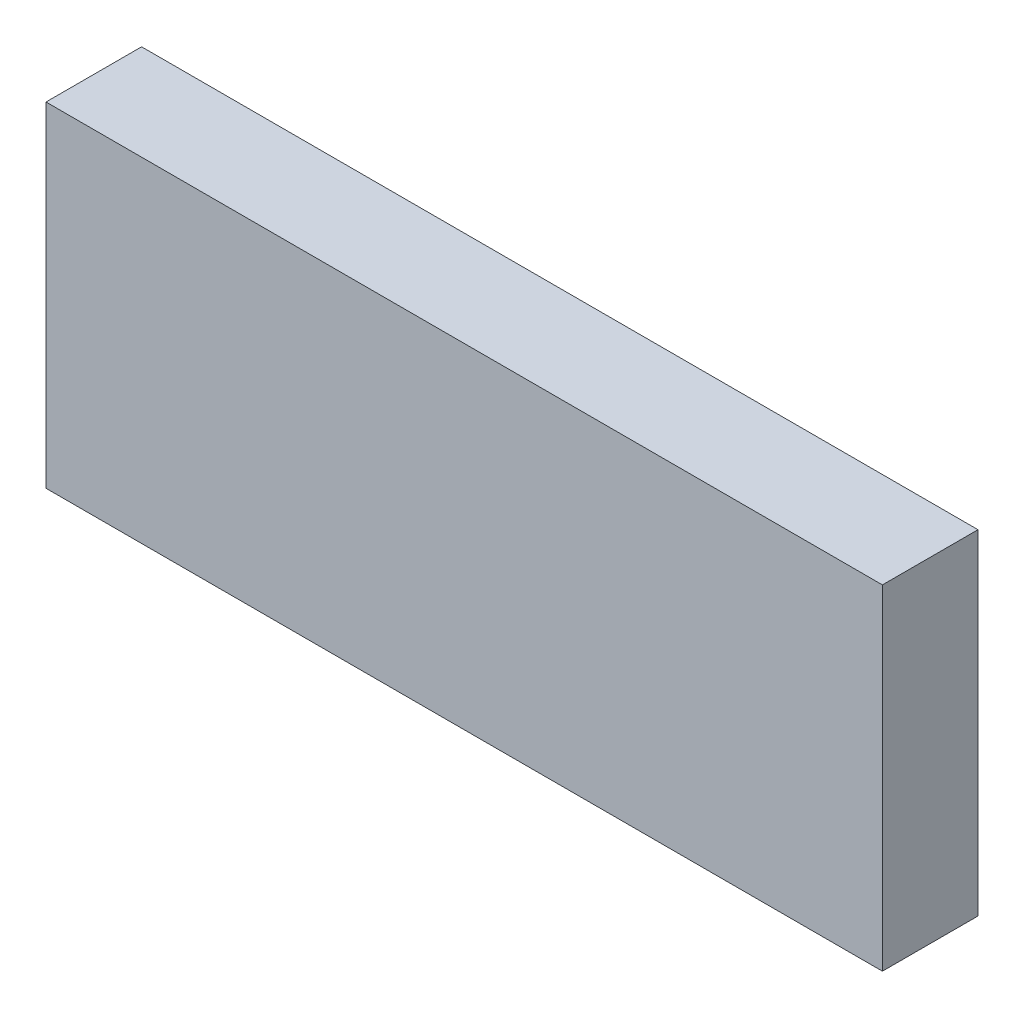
from build123d import *

# Parameters (mm, degrees)
SKETCH_1_W                  = 35
SKETCH_1_H                  = 14
V2_REF_GRIPPER_FINGER_DEPTH = 4


with BuildPart() as part:
    # Sketch 1 → V2_REF_gripper_finger (new body)
    with BuildSketch(Plane.XY):
        with Locations((17.5, 7)):
            Rectangle(SKETCH_1_W, SKETCH_1_H)
    extrude(amount=V2_REF_GRIPPER_FINGER_DEPTH)


solid = part.part
